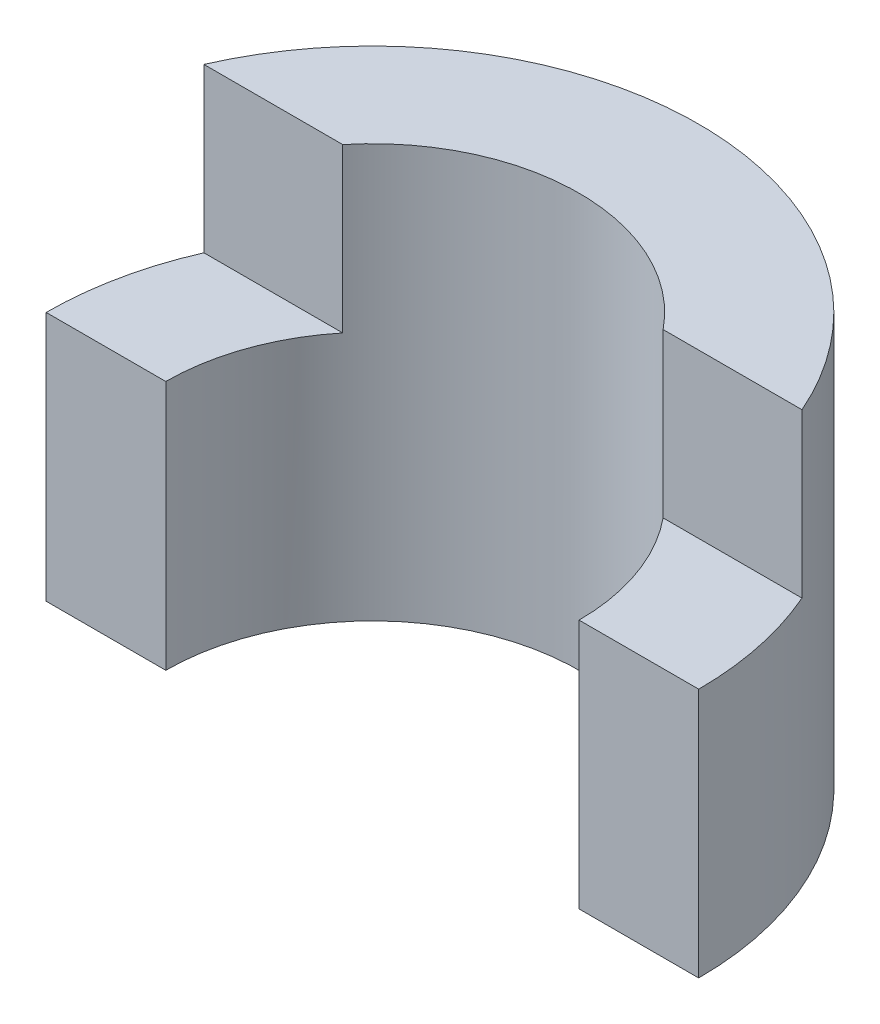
from build123d import *

# Parameters (mm, degrees)
ESQUISSE1_W             = 11
ESQUISSE1_H             = 38
ESQUISSE2_W             = 24
ESQUISSE2_H             = 15.527661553
ENL_V_MAT_EXTRU_1_DEPTH = 40
ESQUISSE4_W             = 64.063226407
ESQUISSE4_H             = 41.841004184
ENL_V_MAT_EXTRU_2_DEPTH = 57.956123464


with BuildPart() as part:
    # Esquisse1 → Base-R_volution (revolve)
    with BuildSketch(Plane.XY, mode=Mode.PRIVATE) as base_r_volution_sk:
        with Locations((24.5, 19)):
            Rectangle(ESQUISSE1_W, ESQUISSE1_H)
    revolve(base_r_volution_sk.sketch.rotate(Axis((0, 46.176987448, 0), (0, -1, 0)), 90), axis=Axis((0, 46.176987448, 0), (0, -1, 0)))

    # Esquisse2 → Enl_v. mat.-Extru.1 (cut, symmetric)
    with BuildSketch(Plane(origin=(0, 0, 0), x_dir=(0, 0, -1), z_dir=(1, 0, 0))):
        with Locations((0, 30.763830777)):
            Rectangle(ESQUISSE2_W, ESQUISSE2_H)
    extrude(amount=ENL_V_MAT_EXTRU_1_DEPTH, both=True, mode=Mode.SUBTRACT)

    # Esquisse4 → Enl_v. mat.-Extru.2 (cut, through all)
    with BuildSketch(Plane.XY):
        with Locations((-0.464900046, 19.139470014)):
            Rectangle(ESQUISSE4_W, ESQUISSE4_H)
    extrude(amount=ENL_V_MAT_EXTRU_2_DEPTH, mode=Mode.SUBTRACT)


solid = part.part
